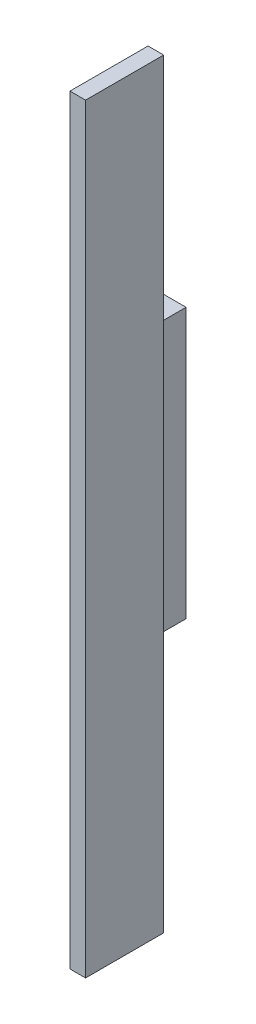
ISO-10303-21;
HEADER;
FILE_DESCRIPTION(('STEP AP214'),'2;1');
FILE_NAME('part.step','',(''),(''),'','','');
FILE_SCHEMA(('AUTOMOTIVE_DESIGN { 1 0 10303 214 1 1 1 1 }'));
ENDSEC;
DATA;
#1=APPLICATION_CONTEXT('core data for automotive mechanical design processes');
#2=APPLICATION_PROTOCOL_DEFINITION('international standard','automotive_design',2000,#1);
#3=PRODUCT_CONTEXT('',#1,'mechanical');
#4=PRODUCT('Part','Part','',(#3));
#5=PRODUCT_RELATED_PRODUCT_CATEGORY('part','',(#4));
#6=PRODUCT_DEFINITION_FORMATION('','',#4);
#7=PRODUCT_DEFINITION_CONTEXT('part definition',#1,'design');
#8=PRODUCT_DEFINITION('design','',#6,#7);
#9=PRODUCT_DEFINITION_SHAPE('','',#8);
#10=(LENGTH_UNIT() NAMED_UNIT(*) SI_UNIT(.MILLI.,.METRE.));
#11=(NAMED_UNIT(*) PLANE_ANGLE_UNIT() SI_UNIT($,.RADIAN.));
#12=(NAMED_UNIT(*) SI_UNIT($,.STERADIAN.) SOLID_ANGLE_UNIT());
#13=UNCERTAINTY_MEASURE_WITH_UNIT(LENGTH_MEASURE(1.E-05),#10,'distance_accuracy_value','');
#14=(GEOMETRIC_REPRESENTATION_CONTEXT(3) GLOBAL_UNCERTAINTY_ASSIGNED_CONTEXT((#13)) GLOBAL_UNIT_ASSIGNED_CONTEXT((#10,
#11,#12)) REPRESENTATION_CONTEXT('',''));
#15=CARTESIAN_POINT('',(0.,0.,0.));
#16=DIRECTION('',(0.,0.,1.));
#17=DIRECTION('',(1.,0.,0.));
#18=AXIS2_PLACEMENT_3D('',#15,#16,#17);
#19=CARTESIAN_POINT('',(0.,73.,15.));
#20=DIRECTION('',(-1.,0.,0.));
#21=DIRECTION('',(0.,-1.,0.));
#22=AXIS2_PLACEMENT_3D('',#19,#20,#21);
#23=PLANE('',#22);
#24=DIRECTION('',(0.,-1.,0.));
#25=VECTOR('',#24,1.);
#26=CARTESIAN_POINT('',(0.,-35.,7.69999999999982));
#27=LINE('',#26,#25);
#28=CARTESIAN_POINT('',(0.,35.,7.69999999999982));
#29=VERTEX_POINT('',#28);
#30=CARTESIAN_POINT('',(0.,-35.,7.69999999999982));
#31=VERTEX_POINT('',#30);
#32=EDGE_CURVE('E32',#29,#31,#27,.T.);
#33=ORIENTED_EDGE('',*,*,#32,.T.);
#34=DIRECTION('',(0.,0.,-1.));
#35=VECTOR('',#34,1.);
#36=CARTESIAN_POINT('',(0.,-35.,0.));
#37=LINE('',#36,#35);
#38=CARTESIAN_POINT('',(0.,-35.,0.));
#39=VERTEX_POINT('',#38);
#40=EDGE_CURVE('E18',#31,#39,#37,.T.);
#41=ORIENTED_EDGE('',*,*,#40,.T.);
#42=DIRECTION('',(0.,1.,0.));
#43=VECTOR('',#42,1.);
#44=CARTESIAN_POINT('',(0.,-73.,0.));
#45=LINE('',#44,#43);
#46=CARTESIAN_POINT('',(0.,-73.,0.));
#47=VERTEX_POINT('',#46);
#48=EDGE_CURVE('E178',#47,#39,#45,.T.);
#49=ORIENTED_EDGE('',*,*,#48,.F.);
#50=DIRECTION('',(0.,0.,-1.));
#51=VECTOR('',#50,1.);
#52=CARTESIAN_POINT('',(0.,-73.,15.));
#53=LINE('',#52,#51);
#54=CARTESIAN_POINT('',(0.,-73.,15.));
#55=VERTEX_POINT('',#54);
#56=EDGE_CURVE('E165',#55,#47,#53,.T.);
#57=ORIENTED_EDGE('',*,*,#56,.F.);
#58=DIRECTION('',(0.,-1.,0.));
#59=VECTOR('',#58,1.);
#60=CARTESIAN_POINT('',(0.,73.,15.));
#61=LINE('',#60,#59);
#62=CARTESIAN_POINT('',(0.,73.,15.));
#63=VERTEX_POINT('',#62);
#64=EDGE_CURVE('E155',#63,#55,#61,.T.);
#65=ORIENTED_EDGE('',*,*,#64,.F.);
#66=DIRECTION('',(0.,0.,1.));
#67=VECTOR('',#66,1.);
#68=CARTESIAN_POINT('',(0.,73.,0.));
#69=LINE('',#68,#67);
#70=CARTESIAN_POINT('',(0.,73.,0.));
#71=VERTEX_POINT('',#70);
#72=EDGE_CURVE('E170',#71,#63,#69,.T.);
#73=ORIENTED_EDGE('',*,*,#72,.F.);
#74=CARTESIAN_POINT('',(0.,34.9999999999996,0.));
#75=VERTEX_POINT('',#74);
#76=EDGE_CURVE('E167',#75,#71,#45,.T.);
#77=ORIENTED_EDGE('',*,*,#76,.F.);
#78=DIRECTION('',(0.,0.,1.));
#79=VECTOR('',#78,1.);
#80=CARTESIAN_POINT('',(0.,35.,7.69999999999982));
#81=LINE('',#80,#79);
#82=EDGE_CURVE('E125',#75,#29,#81,.T.);
#83=ORIENTED_EDGE('',*,*,#82,.T.);
#84=EDGE_LOOP('',(#33,#41,#49,#57,#65,#73,#77,#83));
#85=FACE_BOUND('',#84,.T.);
#86=ADVANCED_FACE('F14',(#85),#23,.T.);
#87=CARTESIAN_POINT('',(3.,73.,15.));
#88=DIRECTION('',(0.,0.,-1.));
#89=DIRECTION('',(0.,1.,0.));
#90=AXIS2_PLACEMENT_3D('',#87,#88,#89);
#91=PLANE('',#90);
#92=ORIENTED_EDGE('',*,*,#64,.T.);
#93=DIRECTION('',(-1.,0.,0.));
#94=VECTOR('',#93,1.);
#95=CARTESIAN_POINT('',(3.,-73.,15.));
#96=LINE('',#95,#94);
#97=CARTESIAN_POINT('',(3.,-73.,15.));
#98=VERTEX_POINT('',#97);
#99=EDGE_CURVE('E9',#98,#55,#96,.T.);
#100=ORIENTED_EDGE('',*,*,#99,.F.);
#101=DIRECTION('',(0.,-1.,0.));
#102=VECTOR('',#101,1.);
#103=CARTESIAN_POINT('',(3.,73.,15.));
#104=LINE('',#103,#102);
#105=CARTESIAN_POINT('',(3.,73.,15.));
#106=VERTEX_POINT('',#105);
#107=EDGE_CURVE('E196',#106,#98,#104,.T.);
#108=ORIENTED_EDGE('',*,*,#107,.F.);
#109=DIRECTION('',(-1.,0.,0.));
#110=VECTOR('',#109,1.);
#111=CARTESIAN_POINT('',(3.,73.,15.));
#112=LINE('',#111,#110);
#113=EDGE_CURVE('E193',#106,#63,#112,.T.);
#114=ORIENTED_EDGE('',*,*,#113,.T.);
#115=EDGE_LOOP('',(#92,#100,#108,#114));
#116=FACE_BOUND('',#115,.T.);
#117=ADVANCED_FACE('F16',(#116),#91,.F.);
#118=CARTESIAN_POINT('',(3.,-73.,15.));
#119=DIRECTION('',(0.,1.,0.));
#120=DIRECTION('',(0.,0.,1.));
#121=AXIS2_PLACEMENT_3D('',#118,#119,#120);
#122=PLANE('',#121);
#123=ORIENTED_EDGE('',*,*,#56,.T.);
#124=DIRECTION('',(-1.,0.,0.));
#125=VECTOR('',#124,1.);
#126=CARTESIAN_POINT('',(3.,-73.,0.));
#127=LINE('',#126,#125);
#128=CARTESIAN_POINT('',(3.,-73.,0.));
#129=VERTEX_POINT('',#128);
#130=EDGE_CURVE('E24',#129,#47,#127,.T.);
#131=ORIENTED_EDGE('',*,*,#130,.F.);
#132=DIRECTION('',(0.,0.,-1.));
#133=VECTOR('',#132,1.);
#134=CARTESIAN_POINT('',(3.,-73.,15.));
#135=LINE('',#134,#133);
#136=EDGE_CURVE('E197',#98,#129,#135,.T.);
#137=ORIENTED_EDGE('',*,*,#136,.F.);
#138=ORIENTED_EDGE('',*,*,#99,.T.);
#139=EDGE_LOOP('',(#123,#131,#137,#138));
#140=FACE_BOUND('',#139,.T.);
#141=ADVANCED_FACE('F208',(#140),#122,.F.);
#142=CARTESIAN_POINT('',(3.,-73.,0.));
#143=DIRECTION('',(0.,0.,1.));
#144=DIRECTION('',(1.,0.,0.));
#145=AXIS2_PLACEMENT_3D('',#142,#143,#144);
#146=PLANE('',#145);
#147=ORIENTED_EDGE('',*,*,#48,.T.);
#148=DIRECTION('',(1.,0.,0.));
#149=VECTOR('',#148,1.);
#150=CARTESIAN_POINT('',(-6.,-35.,0.));
#151=LINE('',#150,#149);
#152=CARTESIAN_POINT('',(-6.,-35.,0.));
#153=VERTEX_POINT('',#152);
#154=EDGE_CURVE('E113',#153,#39,#151,.T.);
#155=ORIENTED_EDGE('',*,*,#154,.F.);
#156=DIRECTION('',(0.,1.,0.));
#157=VECTOR('',#156,1.);
#158=CARTESIAN_POINT('',(-6.,-35.,0.));
#159=LINE('',#158,#157);
#160=CARTESIAN_POINT('',(-6.,-25.9,0.));
#161=VERTEX_POINT('',#160);
#162=EDGE_CURVE('E136',#153,#161,#159,.T.);
#163=ORIENTED_EDGE('',*,*,#162,.T.);
#164=DIRECTION('',(1.,0.,0.));
#165=VECTOR('',#164,1.);
#166=CARTESIAN_POINT('',(-6.,-25.9,0.));
#167=LINE('',#166,#165);
#168=CARTESIAN_POINT('',(0.,-25.9,0.));
#169=VERTEX_POINT('',#168);
#170=EDGE_CURVE('E161',#161,#169,#167,.T.);
#171=ORIENTED_EDGE('',*,*,#170,.T.);
#172=CARTESIAN_POINT('',(0.,25.9,0.));
#173=VERTEX_POINT('',#172);
#174=EDGE_CURVE('E179',#169,#173,#45,.T.);
#175=ORIENTED_EDGE('',*,*,#174,.T.);
#176=DIRECTION('',(1.,0.,0.));
#177=VECTOR('',#176,1.);
#178=CARTESIAN_POINT('',(-6.,25.9,0.));
#179=LINE('',#178,#177);
#180=CARTESIAN_POINT('',(-6.,25.9,0.));
#181=VERTEX_POINT('',#180);
#182=EDGE_CURVE('E159',#181,#173,#179,.T.);
#183=ORIENTED_EDGE('',*,*,#182,.F.);
#184=DIRECTION('',(0.,1.,0.));
#185=VECTOR('',#184,1.);
#186=CARTESIAN_POINT('',(-6.,25.9,0.));
#187=LINE('',#186,#185);
#188=CARTESIAN_POINT('',(-6.,34.9999999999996,0.));
#189=VERTEX_POINT('',#188);
#190=EDGE_CURVE('E148',#181,#189,#187,.T.);
#191=ORIENTED_EDGE('',*,*,#190,.T.);
#192=DIRECTION('',(1.,0.,0.));
#193=VECTOR('',#192,1.);
#194=CARTESIAN_POINT('',(-6.,34.9999999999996,0.));
#195=LINE('',#194,#193);
#196=EDGE_CURVE('E156',#189,#75,#195,.T.);
#197=ORIENTED_EDGE('',*,*,#196,.T.);
#198=ORIENTED_EDGE('',*,*,#76,.T.);
#199=DIRECTION('',(-1.,0.,0.));
#200=VECTOR('',#199,1.);
#201=CARTESIAN_POINT('',(3.,73.,0.));
#202=LINE('',#201,#200);
#203=CARTESIAN_POINT('',(3.,73.,0.));
#204=VERTEX_POINT('',#203);
#205=EDGE_CURVE('E188',#204,#71,#202,.T.);
#206=ORIENTED_EDGE('',*,*,#205,.F.);
#207=DIRECTION('',(0.,1.,0.));
#208=VECTOR('',#207,1.);
#209=CARTESIAN_POINT('',(3.,-73.,0.));
#210=LINE('',#209,#208);
#211=EDGE_CURVE('E200',#129,#204,#210,.T.);
#212=ORIENTED_EDGE('',*,*,#211,.F.);
#213=ORIENTED_EDGE('',*,*,#130,.T.);
#214=EDGE_LOOP('',(#147,#155,#163,#171,#175,#183,#191,#197,#198,#206,#212,#213));
#215=FACE_BOUND('',#214,.T.);
#216=ADVANCED_FACE('F186',(#215),#146,.F.);
#217=CARTESIAN_POINT('',(3.,73.,0.));
#218=DIRECTION('',(0.,-1.,0.));
#219=DIRECTION('',(0.,0.,-1.));
#220=AXIS2_PLACEMENT_3D('',#217,#218,#219);
#221=PLANE('',#220);
#222=ORIENTED_EDGE('',*,*,#72,.T.);
#223=ORIENTED_EDGE('',*,*,#113,.F.);
#224=DIRECTION('',(0.,0.,1.));
#225=VECTOR('',#224,1.);
#226=CARTESIAN_POINT('',(3.,73.,0.));
#227=LINE('',#226,#225);
#228=EDGE_CURVE('E40',#204,#106,#227,.T.);
#229=ORIENTED_EDGE('',*,*,#228,.F.);
#230=ORIENTED_EDGE('',*,*,#205,.T.);
#231=EDGE_LOOP('',(#222,#223,#229,#230));
#232=FACE_BOUND('',#231,.T.);
#233=ADVANCED_FACE('F191',(#232),#221,.F.);
#234=CARTESIAN_POINT('',(3.,73.,15.));
#235=DIRECTION('',(-1.,0.,0.));
#236=DIRECTION('',(0.,-1.,0.));
#237=AXIS2_PLACEMENT_3D('',#234,#235,#236);
#238=PLANE('',#237);
#239=ORIENTED_EDGE('',*,*,#107,.T.);
#240=ORIENTED_EDGE('',*,*,#136,.T.);
#241=ORIENTED_EDGE('',*,*,#211,.T.);
#242=ORIENTED_EDGE('',*,*,#228,.T.);
#243=EDGE_LOOP('',(#239,#240,#241,#242));
#244=FACE_BOUND('',#243,.T.);
#245=ADVANCED_FACE('F224',(#244),#238,.F.);
#246=CARTESIAN_POINT('',(0.,25.9,7.69999999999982));
#247=DIRECTION('',(1.,0.,0.));
#248=DIRECTION('',(0.,1.,0.));
#249=AXIS2_PLACEMENT_3D('',#246,#247,#248);
#250=PLANE('',#249);
#251=ORIENTED_EDGE('',*,*,#174,.F.);
#252=DIRECTION('',(0.,0.,-1.));
#253=VECTOR('',#252,1.);
#254=CARTESIAN_POINT('',(0.,-25.9,0.));
#255=LINE('',#254,#253);
#256=CARTESIAN_POINT('',(0.,-25.9,-7.30000000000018));
#257=VERTEX_POINT('',#256);
#258=EDGE_CURVE('E121',#169,#257,#255,.T.);
#259=ORIENTED_EDGE('',*,*,#258,.T.);
#260=DIRECTION('',(0.,1.,0.));
#261=VECTOR('',#260,1.);
#262=CARTESIAN_POINT('',(0.,-25.9,-7.30000000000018));
#263=LINE('',#262,#261);
#264=CARTESIAN_POINT('',(0.,25.9,-7.30000000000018));
#265=VERTEX_POINT('',#264);
#266=EDGE_CURVE('E129',#257,#265,#263,.T.);
#267=ORIENTED_EDGE('',*,*,#266,.T.);
#268=DIRECTION('',(0.,0.,1.));
#269=VECTOR('',#268,1.);
#270=CARTESIAN_POINT('',(0.,25.9,-7.30000000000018));
#271=LINE('',#270,#269);
#272=EDGE_CURVE('E132',#265,#173,#271,.T.);
#273=ORIENTED_EDGE('',*,*,#272,.T.);
#274=EDGE_LOOP('',(#251,#259,#267,#273));
#275=FACE_BOUND('',#274,.T.);
#276=ADVANCED_FACE('F227',(#275),#250,.T.);
#277=CARTESIAN_POINT('',(-6.,-35.,7.69999999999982));
#278=DIRECTION('',(0.,0.,1.));
#279=DIRECTION('',(1.,0.,0.));
#280=AXIS2_PLACEMENT_3D('',#277,#278,#279);
#281=PLANE('',#280);
#282=ORIENTED_EDGE('',*,*,#32,.F.);
#283=DIRECTION('',(1.,0.,0.));
#284=VECTOR('',#283,1.);
#285=CARTESIAN_POINT('',(-6.,35.,7.69999999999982));
#286=LINE('',#285,#284);
#287=CARTESIAN_POINT('',(-6.,35.,7.69999999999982));
#288=VERTEX_POINT('',#287);
#289=EDGE_CURVE('E153',#288,#29,#286,.T.);
#290=ORIENTED_EDGE('',*,*,#289,.F.);
#291=DIRECTION('',(0.,-1.,0.));
#292=VECTOR('',#291,1.);
#293=CARTESIAN_POINT('',(-6.,-35.,7.69999999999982));
#294=LINE('',#293,#292);
#295=CARTESIAN_POINT('',(-6.,-35.,7.69999999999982));
#296=VERTEX_POINT('',#295);
#297=EDGE_CURVE('E109',#288,#296,#294,.T.);
#298=ORIENTED_EDGE('',*,*,#297,.T.);
#299=DIRECTION('',(1.,0.,0.));
#300=VECTOR('',#299,1.);
#301=CARTESIAN_POINT('',(-6.,-35.,7.69999999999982));
#302=LINE('',#301,#300);
#303=EDGE_CURVE('E105',#296,#31,#302,.T.);
#304=ORIENTED_EDGE('',*,*,#303,.T.);
#305=EDGE_LOOP('',(#282,#290,#298,#304));
#306=FACE_BOUND('',#305,.T.);
#307=ADVANCED_FACE('F107',(#306),#281,.T.);
#308=CARTESIAN_POINT('',(-6.,35.,7.69999999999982));
#309=DIRECTION('',(0.,1.,0.));
#310=DIRECTION('',(0.,0.,1.));
#311=AXIS2_PLACEMENT_3D('',#308,#309,#310);
#312=PLANE('',#311);
#313=ORIENTED_EDGE('',*,*,#82,.F.);
#314=ORIENTED_EDGE('',*,*,#196,.F.);
#315=DIRECTION('',(0.,0.,1.));
#316=VECTOR('',#315,1.);
#317=CARTESIAN_POINT('',(-6.,35.,7.69999999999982));
#318=LINE('',#317,#316);
#319=EDGE_CURVE('E114',#189,#288,#318,.T.);
#320=ORIENTED_EDGE('',*,*,#319,.T.);
#321=ORIENTED_EDGE('',*,*,#289,.T.);
#322=EDGE_LOOP('',(#313,#314,#320,#321));
#323=FACE_BOUND('',#322,.T.);
#324=ADVANCED_FACE('F265',(#323),#312,.T.);
#325=CARTESIAN_POINT('',(-6.,25.9,-7.30000000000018));
#326=DIRECTION('',(0.,1.,0.));
#327=DIRECTION('',(-1.,0.,0.));
#328=AXIS2_PLACEMENT_3D('',#325,#326,#327);
#329=PLANE('',#328);
#330=ORIENTED_EDGE('',*,*,#272,.F.);
#331=DIRECTION('',(1.,0.,0.));
#332=VECTOR('',#331,1.);
#333=CARTESIAN_POINT('',(-6.,25.9,-7.30000000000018));
#334=LINE('',#333,#332);
#335=CARTESIAN_POINT('',(-6.,25.9,-7.30000000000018));
#336=VERTEX_POINT('',#335);
#337=EDGE_CURVE('E157',#336,#265,#334,.T.);
#338=ORIENTED_EDGE('',*,*,#337,.F.);
#339=DIRECTION('',(0.,0.,1.));
#340=VECTOR('',#339,1.);
#341=CARTESIAN_POINT('',(-6.,25.9,-7.30000000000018));
#342=LINE('',#341,#340);
#343=EDGE_CURVE('E145',#336,#181,#342,.T.);
#344=ORIENTED_EDGE('',*,*,#343,.T.);
#345=ORIENTED_EDGE('',*,*,#182,.T.);
#346=EDGE_LOOP('',(#330,#338,#344,#345));
#347=FACE_BOUND('',#346,.T.);
#348=ADVANCED_FACE('F272',(#347),#329,.T.);
#349=CARTESIAN_POINT('',(-6.,-25.9,-7.30000000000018));
#350=DIRECTION('',(0.,0.,-1.));
#351=DIRECTION('',(-1.,0.,0.));
#352=AXIS2_PLACEMENT_3D('',#349,#350,#351);
#353=PLANE('',#352);
#354=ORIENTED_EDGE('',*,*,#266,.F.);
#355=DIRECTION('',(1.,0.,0.));
#356=VECTOR('',#355,1.);
#357=CARTESIAN_POINT('',(-6.,-25.9,-7.30000000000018));
#358=LINE('',#357,#356);
#359=CARTESIAN_POINT('',(-6.,-25.9,-7.30000000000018));
#360=VERTEX_POINT('',#359);
#361=EDGE_CURVE('E160',#360,#257,#358,.T.);
#362=ORIENTED_EDGE('',*,*,#361,.F.);
#363=DIRECTION('',(0.,1.,0.));
#364=VECTOR('',#363,1.);
#365=CARTESIAN_POINT('',(-6.,-25.9,-7.30000000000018));
#366=LINE('',#365,#364);
#367=EDGE_CURVE('E142',#360,#336,#366,.T.);
#368=ORIENTED_EDGE('',*,*,#367,.T.);
#369=ORIENTED_EDGE('',*,*,#337,.T.);
#370=EDGE_LOOP('',(#354,#362,#368,#369));
#371=FACE_BOUND('',#370,.T.);
#372=ADVANCED_FACE('F281',(#371),#353,.T.);
#373=CARTESIAN_POINT('',(-6.,-25.9,0.));
#374=DIRECTION('',(0.,-1.,0.));
#375=DIRECTION('',(1.,0.,0.));
#376=AXIS2_PLACEMENT_3D('',#373,#374,#375);
#377=PLANE('',#376);
#378=ORIENTED_EDGE('',*,*,#258,.F.);
#379=ORIENTED_EDGE('',*,*,#170,.F.);
#380=DIRECTION('',(0.,0.,-1.));
#381=VECTOR('',#380,1.);
#382=CARTESIAN_POINT('',(-6.,-25.9,0.));
#383=LINE('',#382,#381);
#384=EDGE_CURVE('E139',#161,#360,#383,.T.);
#385=ORIENTED_EDGE('',*,*,#384,.T.);
#386=ORIENTED_EDGE('',*,*,#361,.T.);
#387=EDGE_LOOP('',(#378,#379,#385,#386));
#388=FACE_BOUND('',#387,.T.);
#389=ADVANCED_FACE('F290',(#388),#377,.T.);
#390=CARTESIAN_POINT('',(-6.,-35.,0.));
#391=DIRECTION('',(0.,-1.,0.));
#392=DIRECTION('',(1.,0.,0.));
#393=AXIS2_PLACEMENT_3D('',#390,#391,#392);
#394=PLANE('',#393);
#395=ORIENTED_EDGE('',*,*,#40,.F.);
#396=ORIENTED_EDGE('',*,*,#303,.F.);
#397=DIRECTION('',(0.,0.,-1.));
#398=VECTOR('',#397,1.);
#399=CARTESIAN_POINT('',(-6.,-35.,0.));
#400=LINE('',#399,#398);
#401=EDGE_CURVE('E134',#296,#153,#400,.T.);
#402=ORIENTED_EDGE('',*,*,#401,.T.);
#403=ORIENTED_EDGE('',*,*,#154,.T.);
#404=EDGE_LOOP('',(#395,#396,#402,#403));
#405=FACE_BOUND('',#404,.T.);
#406=ADVANCED_FACE('F117',(#405),#394,.T.);
#407=CARTESIAN_POINT('',(-6.,25.9,7.69999999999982));
#408=DIRECTION('',(1.,0.,0.));
#409=DIRECTION('',(0.,1.,0.));
#410=AXIS2_PLACEMENT_3D('',#407,#408,#409);
#411=PLANE('',#410);
#412=ORIENTED_EDGE('',*,*,#297,.F.);
#413=ORIENTED_EDGE('',*,*,#319,.F.);
#414=ORIENTED_EDGE('',*,*,#190,.F.);
#415=ORIENTED_EDGE('',*,*,#343,.F.);
#416=ORIENTED_EDGE('',*,*,#367,.F.);
#417=ORIENTED_EDGE('',*,*,#384,.F.);
#418=ORIENTED_EDGE('',*,*,#162,.F.);
#419=ORIENTED_EDGE('',*,*,#401,.F.);
#420=EDGE_LOOP('',(#412,#413,#414,#415,#416,#417,#418,#419));
#421=FACE_BOUND('',#420,.T.);
#422=ADVANCED_FACE('F307',(#421),#411,.F.);
#423=CLOSED_SHELL('',(#86,#117,#141,#216,#233,#245,#276,#307,#324,#348,#372,#389,#406,#422));
#424=MANIFOLD_SOLID_BREP('B1',#423);
#425=ADVANCED_BREP_SHAPE_REPRESENTATION('',(#18,#424),#14);
#426=SHAPE_DEFINITION_REPRESENTATION(#9,#425);
ENDSEC;
END-ISO-10303-21;
